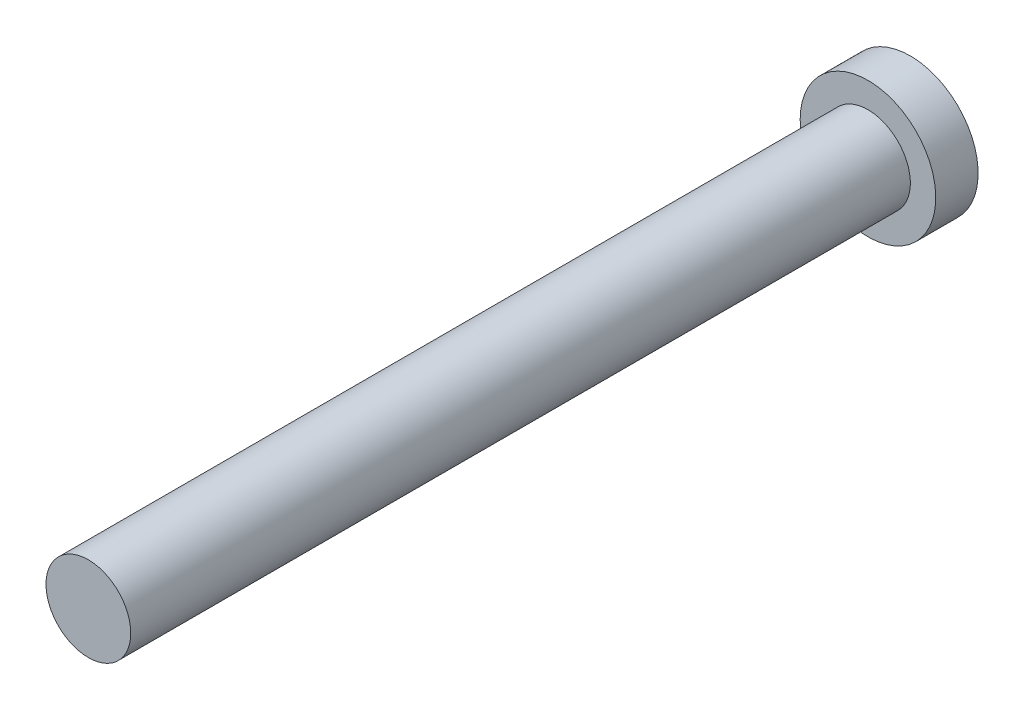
ISO-10303-21;
HEADER;
FILE_DESCRIPTION(('STEP AP214'),'2;1');
FILE_NAME('part.step','',(''),(''),'','','');
FILE_SCHEMA(('AUTOMOTIVE_DESIGN { 1 0 10303 214 1 1 1 1 }'));
ENDSEC;
DATA;
#1=APPLICATION_CONTEXT('core data for automotive mechanical design processes');
#2=APPLICATION_PROTOCOL_DEFINITION('international standard','automotive_design',2000,#1);
#3=PRODUCT_CONTEXT('',#1,'mechanical');
#4=PRODUCT('Part','Part','',(#3));
#5=PRODUCT_RELATED_PRODUCT_CATEGORY('part','',(#4));
#6=PRODUCT_DEFINITION_FORMATION('','',#4);
#7=PRODUCT_DEFINITION_CONTEXT('part definition',#1,'design');
#8=PRODUCT_DEFINITION('design','',#6,#7);
#9=PRODUCT_DEFINITION_SHAPE('','',#8);
#10=(LENGTH_UNIT() NAMED_UNIT(*) SI_UNIT(.MILLI.,.METRE.));
#11=(NAMED_UNIT(*) PLANE_ANGLE_UNIT() SI_UNIT($,.RADIAN.));
#12=(NAMED_UNIT(*) SI_UNIT($,.STERADIAN.) SOLID_ANGLE_UNIT());
#13=UNCERTAINTY_MEASURE_WITH_UNIT(LENGTH_MEASURE(1.E-05),#10,'distance_accuracy_value','');
#14=(GEOMETRIC_REPRESENTATION_CONTEXT(3) GLOBAL_UNCERTAINTY_ASSIGNED_CONTEXT((#13)) GLOBAL_UNIT_ASSIGNED_CONTEXT((#10,
#11,#12)) REPRESENTATION_CONTEXT('',''));
#15=CARTESIAN_POINT('',(0.,0.,0.));
#16=DIRECTION('',(0.,0.,1.));
#17=DIRECTION('',(1.,0.,0.));
#18=AXIS2_PLACEMENT_3D('',#15,#16,#17);
#19=CARTESIAN_POINT('',(0.,1.66533453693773E-13,92.));
#20=DIRECTION('',(0.,0.,-1.));
#21=DIRECTION('',(-1.,0.,0.));
#22=AXIS2_PLACEMENT_3D('',#19,#20,#21);
#23=CYLINDRICAL_SURFACE('',#22,5.);
#24=CARTESIAN_POINT('',(0.,1.66533453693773E-13,92.));
#25=DIRECTION('',(0.,0.,1.));
#26=DIRECTION('',(1.,0.,0.));
#27=AXIS2_PLACEMENT_3D('',#24,#25,#26);
#28=CIRCLE('',#27,5.);
#29=CARTESIAN_POINT('',(5.,-1.73194791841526E-13,92.));
#30=VERTEX_POINT('',#29);
#31=EDGE_CURVE('E12',#30,#30,#28,.T.);
#32=ORIENTED_EDGE('',*,*,#31,.F.);
#33=EDGE_LOOP('',(#32));
#34=FACE_BOUND('',#33,.T.);
#35=CARTESIAN_POINT('',(0.,1.66533453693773E-13,0.));
#36=DIRECTION('',(0.,0.,-1.));
#37=DIRECTION('',(-1.,0.,0.));
#38=AXIS2_PLACEMENT_3D('',#35,#36,#37);
#39=CIRCLE('',#38,5.);
#40=CARTESIAN_POINT('',(-5.,5.06261699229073E-13,0.));
#41=VERTEX_POINT('',#40);
#42=EDGE_CURVE('E51',#41,#41,#39,.T.);
#43=ORIENTED_EDGE('',*,*,#42,.F.);
#44=EDGE_LOOP('',(#43));
#45=FACE_BOUND('',#44,.T.);
#46=ADVANCED_FACE('F45',(#34,#45),#23,.T.);
#47=CARTESIAN_POINT('',(0.,1.66533453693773E-13,92.));
#48=DIRECTION('',(0.,0.,1.));
#49=DIRECTION('',(1.,0.,0.));
#50=AXIS2_PLACEMENT_3D('',#47,#48,#49);
#51=PLANE('',#50);
#52=ORIENTED_EDGE('',*,*,#31,.T.);
#53=EDGE_LOOP('',(#52));
#54=FACE_BOUND('',#53,.T.);
#55=ADVANCED_FACE('F69',(#54),#51,.T.);
#56=CARTESIAN_POINT('',(0.,1.66533453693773E-13,0.));
#57=DIRECTION('',(0.,0.,-1.));
#58=DIRECTION('',(-1.,0.,0.));
#59=AXIS2_PLACEMENT_3D('',#56,#57,#58);
#60=PLANE('',#59);
#61=CARTESIAN_POINT('',(0.,1.66533453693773E-13,0.));
#62=DIRECTION('',(0.,0.,-1.));
#63=DIRECTION('',(-1.,0.,0.));
#64=AXIS2_PLACEMENT_3D('',#61,#62,#63);
#65=CIRCLE('',#64,8.);
#66=CARTESIAN_POINT('',(-8.,7.10098646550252E-13,0.));
#67=VERTEX_POINT('',#66);
#68=EDGE_CURVE('E59',#67,#67,#65,.T.);
#69=ORIENTED_EDGE('',*,*,#68,.F.);
#70=EDGE_LOOP('',(#69));
#71=FACE_BOUND('',#70,.T.);
#72=ORIENTED_EDGE('',*,*,#42,.T.);
#73=EDGE_LOOP('',(#72));
#74=FACE_BOUND('',#73,.T.);
#75=ADVANCED_FACE('F67',(#71,#74),#60,.F.);
#76=CARTESIAN_POINT('',(0.,-1.06026298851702E-11,-4.99999999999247));
#77=DIRECTION('',(0.,0.,1.));
#78=DIRECTION('',(1.,0.,0.));
#79=AXIS2_PLACEMENT_3D('',#76,#77,#78);
#80=CYLINDRICAL_SURFACE('',#79,8.);
#81=CARTESIAN_POINT('',(0.,-1.06026298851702E-11,-4.99999999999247));
#82=DIRECTION('',(0.,0.,-1.));
#83=DIRECTION('',(-1.,0.,0.));
#84=AXIS2_PLACEMENT_3D('',#81,#82,#83);
#85=CIRCLE('',#84,8.);
#86=CARTESIAN_POINT('',(-8.,-1.00590646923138E-11,-4.99999999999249));
#87=VERTEX_POINT('',#86);
#88=EDGE_CURVE('E55',#87,#87,#85,.T.);
#89=ORIENTED_EDGE('',*,*,#88,.F.);
#90=EDGE_LOOP('',(#89));
#91=FACE_BOUND('',#90,.T.);
#92=ORIENTED_EDGE('',*,*,#68,.T.);
#93=EDGE_LOOP('',(#92));
#94=FACE_BOUND('',#93,.T.);
#95=ADVANCED_FACE('F65',(#91,#94),#80,.T.);
#96=CARTESIAN_POINT('',(0.,-1.06026298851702E-11,-4.99999999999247));
#97=DIRECTION('',(0.,0.,-1.));
#98=DIRECTION('',(-1.,0.,0.));
#99=AXIS2_PLACEMENT_3D('',#96,#97,#98);
#100=PLANE('',#99);
#101=ORIENTED_EDGE('',*,*,#88,.T.);
#102=EDGE_LOOP('',(#101));
#103=FACE_BOUND('',#102,.T.);
#104=ADVANCED_FACE('F75',(#103),#100,.T.);
#105=CLOSED_SHELL('',(#46,#55,#75,#95,#104));
#106=MANIFOLD_SOLID_BREP('B2',#105);
#107=ADVANCED_BREP_SHAPE_REPRESENTATION('',(#18,#106),#14);
#108=SHAPE_DEFINITION_REPRESENTATION(#9,#107);
ENDSEC;
END-ISO-10303-21;
